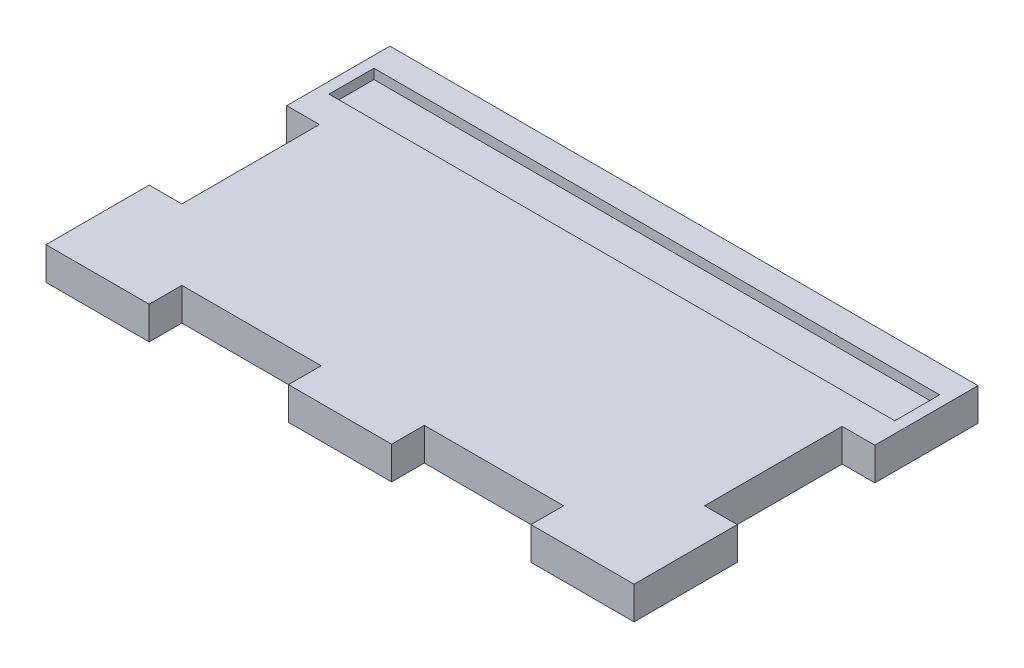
from build123d import *

# Parameters (mm, degrees)
ESQUISSE1_W             = 342
ESQUISSE1_H             = 200
BOSS_EXTRU_1_DEPTH      = 19
ENL_V_MAT_EXTRU_1_REACH = 201.003
ESQUISSE2_W             = 19
ESQUISSE2_H             = 80
ESQUISSE2_W_2           = 81
ESQUISSE2_H_2           = 19
ESQUISSE4_W             = 329
ESQUISSE4_H             = 26.1
ENL_V_MAT_EXTRU_2_DEPTH = 5.7


with BuildPart() as part:
    # Esquisse1 → Boss.-Extru.1 (new body)
    with BuildSketch(Plane(origin=(0, 0, 0), x_dir=(1, 0, 0), z_dir=(0, 1, 0))):
        Rectangle(ESQUISSE1_W, ESQUISSE1_H)
    extrude(amount=BOSS_EXTRU_1_DEPTH)

    # Esquisse2 → Enl_v. mat.-Extru.1 (cut, up to next)
    with BuildSketch(Plane(origin=(0, 19, 0), x_dir=(1, 0, 0), z_dir=(0, 1, 0)), mode=Mode.PRIVATE) as enl_v_mat_extru_1_sk1:
        with Locations((161.5, 0)):
            Rectangle(ESQUISSE2_W, ESQUISSE2_H)
    enl_v_mat_extru_1_tool1 = extrude(enl_v_mat_extru_1_sk1.sketch, amount=-ENL_V_MAT_EXTRU_1_REACH, mode=Mode.PRIVATE) & part.part
    # Esquisse2 → Enl_v. mat.-Extru.1 (cut, up to next)
    with BuildSketch(Plane(origin=(0, 19, 0), x_dir=(1, 0, 0), z_dir=(0, 1, 0)), mode=Mode.PRIVATE) as enl_v_mat_extru_1_sk2:
        with Locations((70.5, -90.5)):
            Rectangle(ESQUISSE2_W_2, ESQUISSE2_H_2)
    enl_v_mat_extru_1_tool2 = extrude(enl_v_mat_extru_1_sk2.sketch, amount=-ENL_V_MAT_EXTRU_1_REACH, mode=Mode.PRIVATE) & part.part
    enl_v_mat_extru_1_1 = enl_v_mat_extru_1_tool1.solids().sort_by_distance((161.5, 19, 0))[0]
    add(enl_v_mat_extru_1_1, mode=Mode.SUBTRACT)
    enl_v_mat_extru_1_2 = enl_v_mat_extru_1_tool2.solids().sort_by_distance((70.5, 19, 90.5))[0]
    add(enl_v_mat_extru_1_2, mode=Mode.SUBTRACT)
    enl_v_mat_extru_1 = enl_v_mat_extru_1_1 + enl_v_mat_extru_1_2  # Enl_v. mat.-Extru.1 as one shape, for the pattern or mirror that repeats it

    # Sym_trie2: Enl_v. mat.-Extru.1 across plane
    add(enl_v_mat_extru_1.mirror(Plane(origin=(0, 0, 0), x_dir=(0, 0, 1), z_dir=(1, 0, 0))), mode=Mode.SUBTRACT)

    # Esquisse4 → Enl_v. mat.-Extru.2 (cut)
    with BuildSketch(Plane(origin=(0, 19, 0), x_dir=(1, 0, 0), z_dir=(0, 1, 0))):
        with Locations((0, 71.15)):
            Rectangle(ESQUISSE4_W, ESQUISSE4_H)
    extrude(amount=-ENL_V_MAT_EXTRU_2_DEPTH, mode=Mode.SUBTRACT)


solid = part.part
